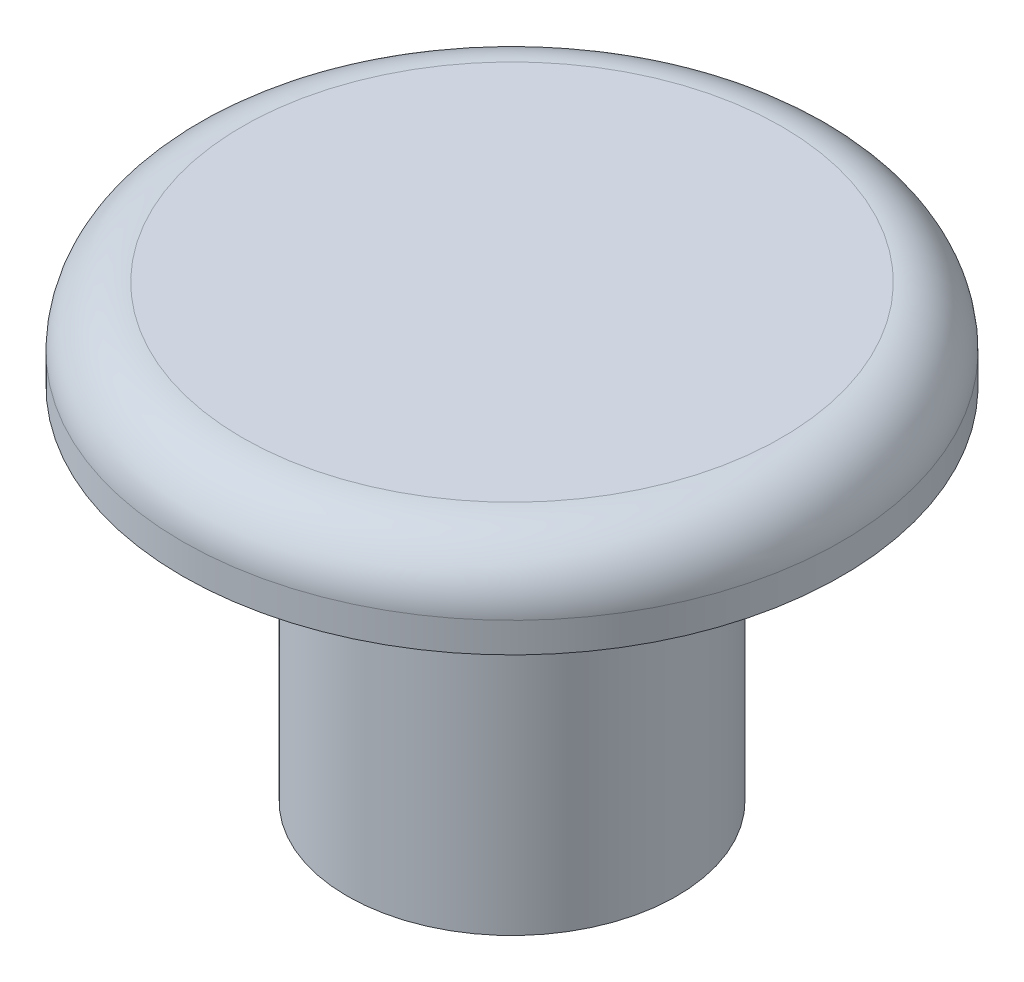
from build123d import *

# Parameters (mm, degrees)
FILLET1_R = 2


with BuildPart() as part:
    # Sketch1 → Revolve1 (revolve)
    with BuildSketch(Plane.XY, mode=Mode.PRIVATE) as revolve1_sk:
        Polygon((0, 0), (5.5, 0), (5.5, 12), (11, 12), (11, 15), (0, 15), align=None)
    revolve(revolve1_sk.sketch.rotate(Axis((0, 0, 0), (0, -1, 0)), 90), axis=Axis((0, 0, 0), (0, -1, 0)))

    # Fillet1
    fillet1_edges = [part.edges().sort_by_distance(p)[0] for p in [
        (0, 15, -11),
    ]]
    fillet(fillet1_edges, radius=FILLET1_R)


solid = part.part
